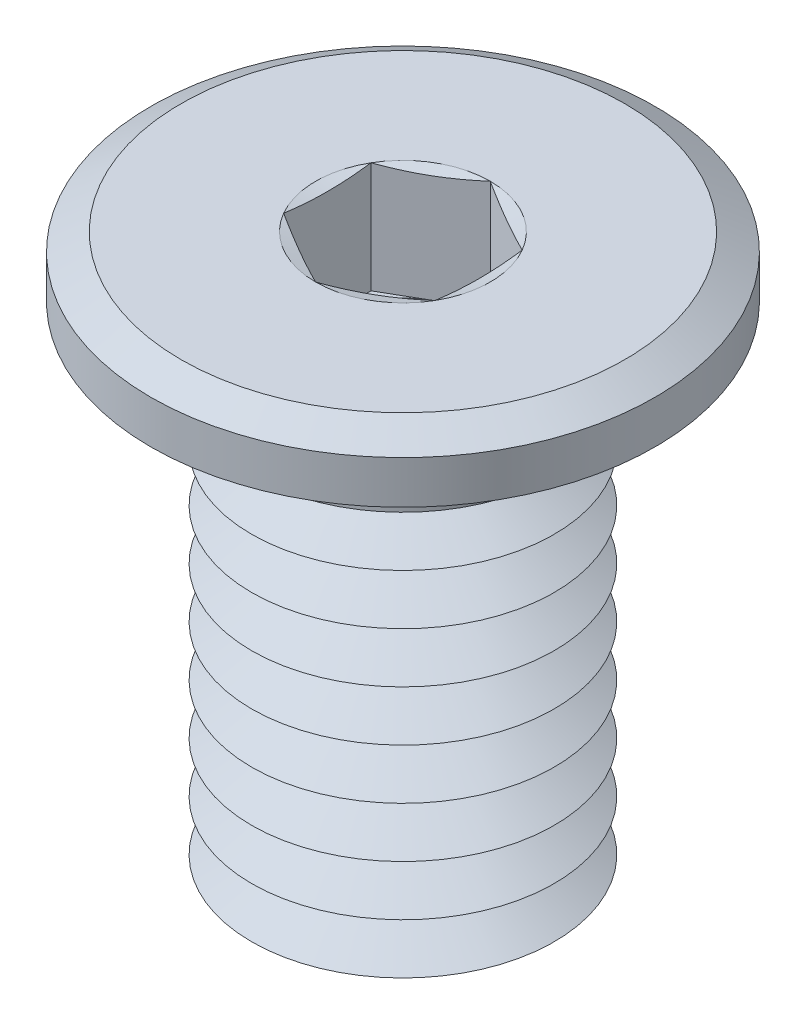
ISO-10303-21;
HEADER;
FILE_DESCRIPTION(('STEP AP214'),'2;1');
FILE_NAME('part.step','',(''),(''),'','','');
FILE_SCHEMA(('AUTOMOTIVE_DESIGN { 1 0 10303 214 1 1 1 1 }'));
ENDSEC;
DATA;
#1=APPLICATION_CONTEXT('core data for automotive mechanical design processes');
#2=APPLICATION_PROTOCOL_DEFINITION('international standard','automotive_design',2000,#1);
#3=PRODUCT_CONTEXT('',#1,'mechanical');
#4=PRODUCT('Part','Part','',(#3));
#5=PRODUCT_RELATED_PRODUCT_CATEGORY('part','',(#4));
#6=PRODUCT_DEFINITION_FORMATION('','',#4);
#7=PRODUCT_DEFINITION_CONTEXT('part definition',#1,'design');
#8=PRODUCT_DEFINITION('design','',#6,#7);
#9=PRODUCT_DEFINITION_SHAPE('','',#8);
#10=(LENGTH_UNIT() NAMED_UNIT(*) SI_UNIT(.MILLI.,.METRE.));
#11=(NAMED_UNIT(*) PLANE_ANGLE_UNIT() SI_UNIT($,.RADIAN.));
#12=(NAMED_UNIT(*) SI_UNIT($,.STERADIAN.) SOLID_ANGLE_UNIT());
#13=UNCERTAINTY_MEASURE_WITH_UNIT(LENGTH_MEASURE(1.E-05),#10,'distance_accuracy_value','');
#14=(GEOMETRIC_REPRESENTATION_CONTEXT(3) GLOBAL_UNCERTAINTY_ASSIGNED_CONTEXT((#13)) GLOBAL_UNIT_ASSIGNED_CONTEXT((#10,
#11,#12)) REPRESENTATION_CONTEXT('',''));
#15=CARTESIAN_POINT('',(0.,0.,0.));
#16=DIRECTION('',(0.,0.,1.));
#17=DIRECTION('',(1.,0.,0.));
#18=AXIS2_PLACEMENT_3D('',#15,#16,#17);
#19=CARTESIAN_POINT('',(0.,-9.7,0.));
#20=DIRECTION('',(0.,-1.,0.));
#21=DIRECTION('',(0.,0.,-1.));
#22=AXIS2_PLACEMENT_3D('',#19,#20,#21);
#23=CONICAL_SURFACE('',#22,3.,1.0471975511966);
#24=CARTESIAN_POINT('',(0.,-9.2,0.));
#25=DIRECTION('',(0.,1.,0.));
#26=DIRECTION('',(0.,0.,1.));
#27=AXIS2_PLACEMENT_3D('',#24,#25,#26);
#28=CIRCLE('',#27,2.13397459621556);
#29=CARTESIAN_POINT('',(0.,-9.2,2.13397459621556));
#30=VERTEX_POINT('',#29);
#31=EDGE_CURVE('E425',#30,#30,#28,.T.);
#32=ORIENTED_EDGE('',*,*,#31,.F.);
#33=EDGE_LOOP('',(#32));
#34=FACE_BOUND('',#33,.T.);
#35=CARTESIAN_POINT('',(0.,-9.7,0.));
#36=DIRECTION('',(0.,1.,0.));
#37=DIRECTION('',(0.,0.,1.));
#38=AXIS2_PLACEMENT_3D('',#35,#36,#37);
#39=CIRCLE('',#38,3.);
#40=CARTESIAN_POINT('',(0.,-9.7,3.));
#41=VERTEX_POINT('',#40);
#42=EDGE_CURVE('E429',#41,#41,#39,.T.);
#43=ORIENTED_EDGE('',*,*,#42,.T.);
#44=EDGE_LOOP('',(#43));
#45=FACE_BOUND('',#44,.T.);
#46=ADVANCED_FACE('F39',(#34,#45),#23,.T.);
#47=CARTESIAN_POINT('',(0.,-9.2,0.));
#48=DIRECTION('',(0.,1.,0.));
#49=DIRECTION('',(0.,0.,1.));
#50=AXIS2_PLACEMENT_3D('',#47,#48,#49);
#51=CONICAL_SURFACE('',#50,2.13397459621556,1.0471975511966);
#52=CARTESIAN_POINT('',(0.,-8.7,0.));
#53=DIRECTION('',(0.,1.,0.));
#54=DIRECTION('',(0.,0.,1.));
#55=AXIS2_PLACEMENT_3D('',#52,#53,#54);
#56=CIRCLE('',#55,3.);
#57=CARTESIAN_POINT('',(0.,-8.7,3.));
#58=VERTEX_POINT('',#57);
#59=EDGE_CURVE('E421',#58,#58,#56,.T.);
#60=ORIENTED_EDGE('',*,*,#59,.F.);
#61=EDGE_LOOP('',(#60));
#62=FACE_BOUND('',#61,.T.);
#63=ORIENTED_EDGE('',*,*,#31,.T.);
#64=EDGE_LOOP('',(#63));
#65=FACE_BOUND('',#64,.T.);
#66=ADVANCED_FACE('F233',(#62,#65),#51,.T.);
#67=CARTESIAN_POINT('',(0.,-11.2,0.));
#68=DIRECTION('',(0.,-1.,0.));
#69=DIRECTION('',(0.,0.,-1.));
#70=AXIS2_PLACEMENT_3D('',#67,#68,#69);
#71=PLANE('',#70);
#72=CARTESIAN_POINT('',(0.,-11.2,0.));
#73=DIRECTION('',(0.,1.,0.));
#74=DIRECTION('',(0.,0.,1.));
#75=AXIS2_PLACEMENT_3D('',#72,#73,#74);
#76=CIRCLE('',#75,2.13397459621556);
#77=CARTESIAN_POINT('',(0.,-11.2,2.13397459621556));
#78=VERTEX_POINT('',#77);
#79=EDGE_CURVE('E299',#78,#78,#76,.T.);
#80=ORIENTED_EDGE('',*,*,#79,.F.);
#81=EDGE_LOOP('',(#80));
#82=FACE_BOUND('',#81,.T.);
#83=ADVANCED_FACE('F239',(#82),#71,.T.);
#84=CARTESIAN_POINT('',(0.,-11.2,0.));
#85=DIRECTION('',(0.,1.,0.));
#86=DIRECTION('',(0.,0.,1.));
#87=AXIS2_PLACEMENT_3D('',#84,#85,#86);
#88=CONICAL_SURFACE('',#87,2.13397459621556,1.0471975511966);
#89=CARTESIAN_POINT('',(0.,-10.7,0.));
#90=DIRECTION('',(0.,1.,0.));
#91=DIRECTION('',(0.,0.,1.));
#92=AXIS2_PLACEMENT_3D('',#89,#90,#91);
#93=CIRCLE('',#92,3.);
#94=CARTESIAN_POINT('',(0.,-10.7,3.));
#95=VERTEX_POINT('',#94);
#96=EDGE_CURVE('E437',#95,#95,#93,.T.);
#97=ORIENTED_EDGE('',*,*,#96,.F.);
#98=EDGE_LOOP('',(#97));
#99=FACE_BOUND('',#98,.T.);
#100=ORIENTED_EDGE('',*,*,#79,.T.);
#101=EDGE_LOOP('',(#100));
#102=FACE_BOUND('',#101,.T.);
#103=ADVANCED_FACE('F254',(#99,#102),#88,.T.);
#104=CARTESIAN_POINT('',(0.,-10.7,0.));
#105=DIRECTION('',(0.,-1.,0.));
#106=DIRECTION('',(0.,0.,-1.));
#107=AXIS2_PLACEMENT_3D('',#104,#105,#106);
#108=CONICAL_SURFACE('',#107,3.,1.0471975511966);
#109=CARTESIAN_POINT('',(0.,-10.2,0.));
#110=DIRECTION('',(0.,1.,0.));
#111=DIRECTION('',(0.,0.,1.));
#112=AXIS2_PLACEMENT_3D('',#109,#110,#111);
#113=CIRCLE('',#112,2.13397459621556);
#114=CARTESIAN_POINT('',(0.,-10.2,2.13397459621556));
#115=VERTEX_POINT('',#114);
#116=EDGE_CURVE('E433',#115,#115,#113,.T.);
#117=ORIENTED_EDGE('',*,*,#116,.F.);
#118=EDGE_LOOP('',(#117));
#119=FACE_BOUND('',#118,.T.);
#120=ORIENTED_EDGE('',*,*,#96,.T.);
#121=EDGE_LOOP('',(#120));
#122=FACE_BOUND('',#121,.T.);
#123=ADVANCED_FACE('F250',(#119,#122),#108,.T.);
#124=CARTESIAN_POINT('',(0.,-10.2,0.));
#125=DIRECTION('',(0.,1.,0.));
#126=DIRECTION('',(0.,0.,1.));
#127=AXIS2_PLACEMENT_3D('',#124,#125,#126);
#128=CONICAL_SURFACE('',#127,2.13397459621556,1.0471975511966);
#129=ORIENTED_EDGE('',*,*,#42,.F.);
#130=EDGE_LOOP('',(#129));
#131=FACE_BOUND('',#130,.T.);
#132=ORIENTED_EDGE('',*,*,#116,.T.);
#133=EDGE_LOOP('',(#132));
#134=FACE_BOUND('',#133,.T.);
#135=ADVANCED_FACE('F246',(#131,#134),#128,.T.);
#136=CARTESIAN_POINT('',(0.,-8.7,0.));
#137=DIRECTION('',(0.,-1.,0.));
#138=DIRECTION('',(0.,0.,-1.));
#139=AXIS2_PLACEMENT_3D('',#136,#137,#138);
#140=CONICAL_SURFACE('',#139,3.,1.0471975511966);
#141=CARTESIAN_POINT('',(0.,-8.2,0.));
#142=DIRECTION('',(0.,1.,0.));
#143=DIRECTION('',(0.,0.,1.));
#144=AXIS2_PLACEMENT_3D('',#141,#142,#143);
#145=CIRCLE('',#144,2.13397459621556);
#146=CARTESIAN_POINT('',(0.,-8.2,2.13397459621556));
#147=VERTEX_POINT('',#146);
#148=EDGE_CURVE('E417',#147,#147,#145,.T.);
#149=ORIENTED_EDGE('',*,*,#148,.F.);
#150=EDGE_LOOP('',(#149));
#151=FACE_BOUND('',#150,.T.);
#152=ORIENTED_EDGE('',*,*,#59,.T.);
#153=EDGE_LOOP('',(#152));
#154=FACE_BOUND('',#153,.T.);
#155=ADVANCED_FACE('F249',(#151,#154),#140,.T.);
#156=CARTESIAN_POINT('',(0.,-8.2,0.));
#157=DIRECTION('',(0.,1.,0.));
#158=DIRECTION('',(0.,0.,1.));
#159=AXIS2_PLACEMENT_3D('',#156,#157,#158);
#160=CONICAL_SURFACE('',#159,2.13397459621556,1.0471975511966);
#161=CARTESIAN_POINT('',(0.,-7.7,0.));
#162=DIRECTION('',(0.,1.,0.));
#163=DIRECTION('',(0.,0.,1.));
#164=AXIS2_PLACEMENT_3D('',#161,#162,#163);
#165=CIRCLE('',#164,3.);
#166=CARTESIAN_POINT('',(0.,-7.7,3.));
#167=VERTEX_POINT('',#166);
#168=EDGE_CURVE('E413',#167,#167,#165,.T.);
#169=ORIENTED_EDGE('',*,*,#168,.F.);
#170=EDGE_LOOP('',(#169));
#171=FACE_BOUND('',#170,.T.);
#172=ORIENTED_EDGE('',*,*,#148,.T.);
#173=EDGE_LOOP('',(#172));
#174=FACE_BOUND('',#173,.T.);
#175=ADVANCED_FACE('F628',(#171,#174),#160,.T.);
#176=CARTESIAN_POINT('',(0.,-7.7,0.));
#177=DIRECTION('',(0.,-1.,0.));
#178=DIRECTION('',(0.,0.,-1.));
#179=AXIS2_PLACEMENT_3D('',#176,#177,#178);
#180=CONICAL_SURFACE('',#179,3.,1.0471975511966);
#181=CARTESIAN_POINT('',(0.,-7.2,0.));
#182=DIRECTION('',(0.,1.,0.));
#183=DIRECTION('',(0.,0.,1.));
#184=AXIS2_PLACEMENT_3D('',#181,#182,#183);
#185=CIRCLE('',#184,2.13397459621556);
#186=CARTESIAN_POINT('',(0.,-7.2,2.13397459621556));
#187=VERTEX_POINT('',#186);
#188=EDGE_CURVE('E409',#187,#187,#185,.T.);
#189=ORIENTED_EDGE('',*,*,#188,.F.);
#190=EDGE_LOOP('',(#189));
#191=FACE_BOUND('',#190,.T.);
#192=ORIENTED_EDGE('',*,*,#168,.T.);
#193=EDGE_LOOP('',(#192));
#194=FACE_BOUND('',#193,.T.);
#195=ADVANCED_FACE('F619',(#191,#194),#180,.T.);
#196=CARTESIAN_POINT('',(0.,-7.2,0.));
#197=DIRECTION('',(0.,1.,0.));
#198=DIRECTION('',(0.,0.,1.));
#199=AXIS2_PLACEMENT_3D('',#196,#197,#198);
#200=CONICAL_SURFACE('',#199,2.13397459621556,1.0471975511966);
#201=CARTESIAN_POINT('',(0.,-6.7,0.));
#202=DIRECTION('',(0.,1.,0.));
#203=DIRECTION('',(0.,0.,1.));
#204=AXIS2_PLACEMENT_3D('',#201,#202,#203);
#205=CIRCLE('',#204,3.);
#206=CARTESIAN_POINT('',(0.,-6.7,3.));
#207=VERTEX_POINT('',#206);
#208=EDGE_CURVE('E405',#207,#207,#205,.T.);
#209=ORIENTED_EDGE('',*,*,#208,.F.);
#210=EDGE_LOOP('',(#209));
#211=FACE_BOUND('',#210,.T.);
#212=ORIENTED_EDGE('',*,*,#188,.T.);
#213=EDGE_LOOP('',(#212));
#214=FACE_BOUND('',#213,.T.);
#215=ADVANCED_FACE('F610',(#211,#214),#200,.T.);
#216=CARTESIAN_POINT('',(0.,-6.7,0.));
#217=DIRECTION('',(0.,-1.,0.));
#218=DIRECTION('',(0.,0.,-1.));
#219=AXIS2_PLACEMENT_3D('',#216,#217,#218);
#220=CONICAL_SURFACE('',#219,3.,1.0471975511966);
#221=CARTESIAN_POINT('',(0.,-6.2,0.));
#222=DIRECTION('',(0.,1.,0.));
#223=DIRECTION('',(0.,0.,1.));
#224=AXIS2_PLACEMENT_3D('',#221,#222,#223);
#225=CIRCLE('',#224,2.13397459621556);
#226=CARTESIAN_POINT('',(0.,-6.2,2.13397459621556));
#227=VERTEX_POINT('',#226);
#228=EDGE_CURVE('E401',#227,#227,#225,.T.);
#229=ORIENTED_EDGE('',*,*,#228,.F.);
#230=EDGE_LOOP('',(#229));
#231=FACE_BOUND('',#230,.T.);
#232=ORIENTED_EDGE('',*,*,#208,.T.);
#233=EDGE_LOOP('',(#232));
#234=FACE_BOUND('',#233,.T.);
#235=ADVANCED_FACE('F601',(#231,#234),#220,.T.);
#236=CARTESIAN_POINT('',(0.,-6.2,0.));
#237=DIRECTION('',(0.,1.,0.));
#238=DIRECTION('',(0.,0.,1.));
#239=AXIS2_PLACEMENT_3D('',#236,#237,#238);
#240=CONICAL_SURFACE('',#239,2.13397459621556,1.0471975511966);
#241=CARTESIAN_POINT('',(0.,-5.7,0.));
#242=DIRECTION('',(0.,1.,0.));
#243=DIRECTION('',(0.,0.,1.));
#244=AXIS2_PLACEMENT_3D('',#241,#242,#243);
#245=CIRCLE('',#244,3.);
#246=CARTESIAN_POINT('',(0.,-5.7,3.));
#247=VERTEX_POINT('',#246);
#248=EDGE_CURVE('E397',#247,#247,#245,.T.);
#249=ORIENTED_EDGE('',*,*,#248,.F.);
#250=EDGE_LOOP('',(#249));
#251=FACE_BOUND('',#250,.T.);
#252=ORIENTED_EDGE('',*,*,#228,.T.);
#253=EDGE_LOOP('',(#252));
#254=FACE_BOUND('',#253,.T.);
#255=ADVANCED_FACE('F592',(#251,#254),#240,.T.);
#256=CARTESIAN_POINT('',(0.,-5.7,0.));
#257=DIRECTION('',(0.,-1.,0.));
#258=DIRECTION('',(0.,0.,-1.));
#259=AXIS2_PLACEMENT_3D('',#256,#257,#258);
#260=CONICAL_SURFACE('',#259,3.,1.0471975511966);
#261=CARTESIAN_POINT('',(0.,-5.2,0.));
#262=DIRECTION('',(0.,1.,0.));
#263=DIRECTION('',(0.,0.,1.));
#264=AXIS2_PLACEMENT_3D('',#261,#262,#263);
#265=CIRCLE('',#264,2.13397459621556);
#266=CARTESIAN_POINT('',(0.,-5.2,2.13397459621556));
#267=VERTEX_POINT('',#266);
#268=EDGE_CURVE('E393',#267,#267,#265,.T.);
#269=ORIENTED_EDGE('',*,*,#268,.F.);
#270=EDGE_LOOP('',(#269));
#271=FACE_BOUND('',#270,.T.);
#272=ORIENTED_EDGE('',*,*,#248,.T.);
#273=EDGE_LOOP('',(#272));
#274=FACE_BOUND('',#273,.T.);
#275=ADVANCED_FACE('F583',(#271,#274),#260,.T.);
#276=CARTESIAN_POINT('',(0.,-5.2,0.));
#277=DIRECTION('',(0.,1.,0.));
#278=DIRECTION('',(0.,0.,1.));
#279=AXIS2_PLACEMENT_3D('',#276,#277,#278);
#280=CONICAL_SURFACE('',#279,2.13397459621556,1.0471975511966);
#281=CARTESIAN_POINT('',(0.,-4.7,0.));
#282=DIRECTION('',(0.,1.,0.));
#283=DIRECTION('',(0.,0.,1.));
#284=AXIS2_PLACEMENT_3D('',#281,#282,#283);
#285=CIRCLE('',#284,3.);
#286=CARTESIAN_POINT('',(0.,-4.7,3.));
#287=VERTEX_POINT('',#286);
#288=EDGE_CURVE('E390',#287,#287,#285,.T.);
#289=ORIENTED_EDGE('',*,*,#288,.F.);
#290=EDGE_LOOP('',(#289));
#291=FACE_BOUND('',#290,.T.);
#292=ORIENTED_EDGE('',*,*,#268,.T.);
#293=EDGE_LOOP('',(#292));
#294=FACE_BOUND('',#293,.T.);
#295=ADVANCED_FACE('F574',(#291,#294),#280,.T.);
#296=CARTESIAN_POINT('',(0.,-4.7,0.));
#297=DIRECTION('',(0.,-1.,0.));
#298=DIRECTION('',(0.,0.,-1.));
#299=AXIS2_PLACEMENT_3D('',#296,#297,#298);
#300=CONICAL_SURFACE('',#299,3.,1.0471975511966);
#301=CARTESIAN_POINT('',(0.,-4.2,0.));
#302=DIRECTION('',(0.,1.,0.));
#303=DIRECTION('',(0.,0.,1.));
#304=AXIS2_PLACEMENT_3D('',#301,#302,#303);
#305=CIRCLE('',#304,2.13397459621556);
#306=CARTESIAN_POINT('',(0.,-4.2,2.13397459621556));
#307=VERTEX_POINT('',#306);
#308=EDGE_CURVE('E386',#307,#307,#305,.T.);
#309=ORIENTED_EDGE('',*,*,#308,.F.);
#310=EDGE_LOOP('',(#309));
#311=FACE_BOUND('',#310,.T.);
#312=ORIENTED_EDGE('',*,*,#288,.T.);
#313=EDGE_LOOP('',(#312));
#314=FACE_BOUND('',#313,.T.);
#315=ADVANCED_FACE('F565',(#311,#314),#300,.T.);
#316=CARTESIAN_POINT('',(0.,-4.2,0.));
#317=DIRECTION('',(0.,1.,0.));
#318=DIRECTION('',(0.,0.,1.));
#319=AXIS2_PLACEMENT_3D('',#316,#317,#318);
#320=CONICAL_SURFACE('',#319,2.13397459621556,1.0471975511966);
#321=CARTESIAN_POINT('',(0.,-3.7,0.));
#322=DIRECTION('',(0.,1.,0.));
#323=DIRECTION('',(0.,0.,1.));
#324=AXIS2_PLACEMENT_3D('',#321,#322,#323);
#325=CIRCLE('',#324,3.);
#326=CARTESIAN_POINT('',(0.,-3.7,3.));
#327=VERTEX_POINT('',#326);
#328=EDGE_CURVE('E383',#327,#327,#325,.T.);
#329=ORIENTED_EDGE('',*,*,#328,.F.);
#330=EDGE_LOOP('',(#329));
#331=FACE_BOUND('',#330,.T.);
#332=ORIENTED_EDGE('',*,*,#308,.T.);
#333=EDGE_LOOP('',(#332));
#334=FACE_BOUND('',#333,.T.);
#335=ADVANCED_FACE('F556',(#331,#334),#320,.T.);
#336=CARTESIAN_POINT('',(0.,-3.7,0.));
#337=DIRECTION('',(0.,-1.,0.));
#338=DIRECTION('',(0.,0.,-1.));
#339=AXIS2_PLACEMENT_3D('',#336,#337,#338);
#340=CONICAL_SURFACE('',#339,3.,1.0471975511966);
#341=CARTESIAN_POINT('',(0.,-3.2,0.));
#342=DIRECTION('',(0.,1.,0.));
#343=DIRECTION('',(0.,0.,1.));
#344=AXIS2_PLACEMENT_3D('',#341,#342,#343);
#345=CIRCLE('',#344,2.13397459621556);
#346=CARTESIAN_POINT('',(0.,-3.2,2.13397459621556));
#347=VERTEX_POINT('',#346);
#348=EDGE_CURVE('E379',#347,#347,#345,.T.);
#349=ORIENTED_EDGE('',*,*,#348,.F.);
#350=EDGE_LOOP('',(#349));
#351=FACE_BOUND('',#350,.T.);
#352=ORIENTED_EDGE('',*,*,#328,.T.);
#353=EDGE_LOOP('',(#352));
#354=FACE_BOUND('',#353,.T.);
#355=ADVANCED_FACE('F547',(#351,#354),#340,.T.);
#356=CARTESIAN_POINT('',(0.,-3.2,0.));
#357=DIRECTION('',(0.,1.,0.));
#358=DIRECTION('',(0.,0.,1.));
#359=AXIS2_PLACEMENT_3D('',#356,#357,#358);
#360=CONICAL_SURFACE('',#359,2.13397459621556,1.0471975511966);
#361=CARTESIAN_POINT('',(0.,-2.7,0.));
#362=DIRECTION('',(0.,1.,0.));
#363=DIRECTION('',(0.,0.,1.));
#364=AXIS2_PLACEMENT_3D('',#361,#362,#363);
#365=CIRCLE('',#364,3.);
#366=CARTESIAN_POINT('',(0.,-2.7,3.));
#367=VERTEX_POINT('',#366);
#368=EDGE_CURVE('E365',#367,#367,#365,.T.);
#369=ORIENTED_EDGE('',*,*,#368,.F.);
#370=EDGE_LOOP('',(#369));
#371=FACE_BOUND('',#370,.T.);
#372=ORIENTED_EDGE('',*,*,#348,.T.);
#373=EDGE_LOOP('',(#372));
#374=FACE_BOUND('',#373,.T.);
#375=ADVANCED_FACE('F274',(#371,#374),#360,.T.);
#376=CARTESIAN_POINT('',(0.,0.,0.));
#377=DIRECTION('',(0.,1.,0.));
#378=DIRECTION('',(0.,0.,1.));
#379=AXIS2_PLACEMENT_3D('',#376,#377,#378);
#380=PLANE('',#379);
#381=CARTESIAN_POINT('',(0.,0.,0.));
#382=DIRECTION('',(0.,1.,0.));
#383=DIRECTION('',(0.,0.,1.));
#384=AXIS2_PLACEMENT_3D('',#381,#382,#383);
#385=CIRCLE('',#384,1.73205080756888);
#386=CARTESIAN_POINT('',(0.,0.,1.73205080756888));
#387=VERTEX_POINT('',#386);
#388=CARTESIAN_POINT('',(1.5,0.,0.86602540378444));
#389=VERTEX_POINT('',#388);
#390=EDGE_CURVE('E66',#387,#389,#385,.T.);
#391=ORIENTED_EDGE('',*,*,#390,.F.);
#392=CARTESIAN_POINT('',(-1.5,0.,0.866025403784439));
#393=VERTEX_POINT('',#392);
#394=EDGE_CURVE('E169',#393,#387,#385,.T.);
#395=ORIENTED_EDGE('',*,*,#394,.F.);
#396=CARTESIAN_POINT('',(-1.5,0.,-0.86602540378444));
#397=VERTEX_POINT('',#396);
#398=EDGE_CURVE('E164',#397,#393,#385,.T.);
#399=ORIENTED_EDGE('',*,*,#398,.F.);
#400=CARTESIAN_POINT('',(0.,0.,-1.73205080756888));
#401=VERTEX_POINT('',#400);
#402=EDGE_CURVE('E128',#401,#397,#385,.T.);
#403=ORIENTED_EDGE('',*,*,#402,.F.);
#404=CARTESIAN_POINT('',(1.5,0.,-0.866025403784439));
#405=VERTEX_POINT('',#404);
#406=EDGE_CURVE('E119',#405,#401,#385,.T.);
#407=ORIENTED_EDGE('',*,*,#406,.F.);
#408=EDGE_CURVE('E59',#389,#405,#385,.T.);
#409=ORIENTED_EDGE('',*,*,#408,.F.);
#410=EDGE_LOOP('',(#391,#395,#399,#403,#407,#409));
#411=FACE_BOUND('',#410,.T.);
#412=CARTESIAN_POINT('',(0.,0.,0.));
#413=DIRECTION('',(0.,1.,0.));
#414=DIRECTION('',(0.,0.,1.));
#415=AXIS2_PLACEMENT_3D('',#412,#413,#414);
#416=CIRCLE('',#415,4.4);
#417=CARTESIAN_POINT('',(0.,0.,4.4));
#418=VERTEX_POINT('',#417);
#419=EDGE_CURVE('E295',#418,#418,#416,.T.);
#420=ORIENTED_EDGE('',*,*,#419,.T.);
#421=EDGE_LOOP('',(#420));
#422=FACE_BOUND('',#421,.T.);
#423=ADVANCED_FACE('F160',(#411,#422),#380,.T.);
#424=CARTESIAN_POINT('',(0.,-1.2,0.));
#425=DIRECTION('',(0.,1.,0.));
#426=DIRECTION('',(0.,0.,1.));
#427=AXIS2_PLACEMENT_3D('',#424,#425,#426);
#428=CYLINDRICAL_SURFACE('',#427,5.);
#429=CARTESIAN_POINT('',(0.,-0.346410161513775,0.));
#430=DIRECTION('',(0.,1.,0.));
#431=DIRECTION('',(0.,0.,1.));
#432=AXIS2_PLACEMENT_3D('',#429,#430,#431);
#433=CIRCLE('',#432,5.);
#434=CARTESIAN_POINT('',(0.,-0.346410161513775,5.));
#435=VERTEX_POINT('',#434);
#436=EDGE_CURVE('E306',#435,#435,#433,.F.);
#437=ORIENTED_EDGE('',*,*,#436,.T.);
#438=EDGE_LOOP('',(#437));
#439=FACE_BOUND('',#438,.T.);
#440=CARTESIAN_POINT('',(0.,-1.2,0.));
#441=DIRECTION('',(0.,1.,0.));
#442=DIRECTION('',(0.,0.,1.));
#443=AXIS2_PLACEMENT_3D('',#440,#441,#442);
#444=CIRCLE('',#443,5.);
#445=CARTESIAN_POINT('',(0.,-1.2,5.));
#446=VERTEX_POINT('',#445);
#447=EDGE_CURVE('E291',#446,#446,#444,.T.);
#448=ORIENTED_EDGE('',*,*,#447,.T.);
#449=EDGE_LOOP('',(#448));
#450=FACE_BOUND('',#449,.T.);
#451=ADVANCED_FACE('F270',(#439,#450),#428,.T.);
#452=CARTESIAN_POINT('',(0.,-1.2,0.));
#453=DIRECTION('',(0.,1.,0.));
#454=DIRECTION('',(0.,0.,1.));
#455=AXIS2_PLACEMENT_3D('',#452,#453,#454);
#456=PLANE('',#455);
#457=CARTESIAN_POINT('',(0.,-1.2,0.));
#458=DIRECTION('',(0.,1.,0.));
#459=DIRECTION('',(0.,0.,1.));
#460=AXIS2_PLACEMENT_3D('',#457,#458,#459);
#461=CIRCLE('',#460,3.25);
#462=CARTESIAN_POINT('',(0.,-1.2,3.25));
#463=VERTEX_POINT('',#462);
#464=EDGE_CURVE('E286',#463,#463,#461,.T.);
#465=ORIENTED_EDGE('',*,*,#464,.T.);
#466=EDGE_LOOP('',(#465));
#467=FACE_BOUND('',#466,.T.);
#468=ORIENTED_EDGE('',*,*,#447,.F.);
#469=EDGE_LOOP('',(#468));
#470=FACE_BOUND('',#469,.T.);
#471=ADVANCED_FACE('F266',(#467,#470),#456,.F.);
#472=CARTESIAN_POINT('',(0.,-11.2,0.));
#473=DIRECTION('',(0.,1.,0.));
#474=DIRECTION('',(0.,0.,1.));
#475=AXIS2_PLACEMENT_3D('',#472,#473,#474);
#476=CYLINDRICAL_SURFACE('',#475,3.);
#477=CARTESIAN_POINT('',(0.,-1.45,0.));
#478=DIRECTION('',(0.,1.,0.));
#479=DIRECTION('',(0.,0.,1.));
#480=AXIS2_PLACEMENT_3D('',#477,#478,#479);
#481=CIRCLE('',#480,3.);
#482=CARTESIAN_POINT('',(0.,-1.45,3.));
#483=VERTEX_POINT('',#482);
#484=EDGE_CURVE('E289',#483,#483,#481,.F.);
#485=ORIENTED_EDGE('',*,*,#484,.T.);
#486=EDGE_LOOP('',(#485));
#487=FACE_BOUND('',#486,.T.);
#488=ORIENTED_EDGE('',*,*,#368,.T.);
#489=EDGE_LOOP('',(#488));
#490=FACE_BOUND('',#489,.T.);
#491=ADVANCED_FACE('F262',(#487,#490),#476,.T.);
#492=CARTESIAN_POINT('',(0.,-1.45,0.));
#493=DIRECTION('',(0.,1.,0.));
#494=DIRECTION('',(0.,0.,1.));
#495=AXIS2_PLACEMENT_3D('',#492,#493,#494);
#496=TOROIDAL_SURFACE('',#495,3.25,0.25);
#497=ORIENTED_EDGE('',*,*,#464,.F.);
#498=EDGE_LOOP('',(#497));
#499=FACE_BOUND('',#498,.T.);
#500=ORIENTED_EDGE('',*,*,#484,.F.);
#501=EDGE_LOOP('',(#500));
#502=FACE_BOUND('',#501,.T.);
#503=ADVANCED_FACE('F265',(#499,#502),#496,.F.);
#504=CARTESIAN_POINT('',(0.,0.,0.));
#505=DIRECTION('',(0.,-1.,0.));
#506=DIRECTION('',(0.,0.,-1.));
#507=AXIS2_PLACEMENT_3D('',#504,#505,#506);
#508=CONICAL_SURFACE('',#507,4.4,1.0471975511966);
#509=ORIENTED_EDGE('',*,*,#436,.F.);
#510=EDGE_LOOP('',(#509));
#511=FACE_BOUND('',#510,.T.);
#512=ORIENTED_EDGE('',*,*,#419,.F.);
#513=EDGE_LOOP('',(#512));
#514=FACE_BOUND('',#513,.T.);
#515=ADVANCED_FACE('F41',(#511,#514),#508,.T.);
#516=CARTESIAN_POINT('',(0.,0.,0.));
#517=DIRECTION('',(0.,1.,0.));
#518=DIRECTION('',(0.,0.,1.));
#519=AXIS2_PLACEMENT_3D('',#516,#517,#518);
#520=CONICAL_SURFACE('',#519,1.73205080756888,1.30899693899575);
#521=ORIENTED_EDGE('',*,*,#402,.T.);
#522=CARTESIAN_POINT('',(0.000200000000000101,3.09432014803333E-05,-1.73216627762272));
#523=CARTESIAN_POINT('',(-0.0621077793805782,-0.00961367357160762,-1.69619286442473));
#524=CARTESIAN_POINT('',(-0.124528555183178,-0.0183695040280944,-1.66015421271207));
#525=CARTESIAN_POINT('',(-0.249590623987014,-0.0337528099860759,-1.58794959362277));
#526=CARTESIAN_POINT('',(-0.312231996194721,-0.0403794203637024,-1.55178358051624));
#527=CARTESIAN_POINT('',(-0.437355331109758,-0.0511173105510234,-1.47954358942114));
#528=CARTESIAN_POINT('',(-0.499836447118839,-0.0552413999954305,-1.44347010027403));
#529=CARTESIAN_POINT('',(-0.624878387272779,-0.0607713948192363,-1.37127710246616));
#530=CARTESIAN_POINT('',(-0.68743919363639,-0.0621778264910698,-1.33515760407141));
#531=CARTESIAN_POINT('',(-0.81256080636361,-0.0621778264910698,-1.26291860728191));
#532=CARTESIAN_POINT('',(-0.875121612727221,-0.0607713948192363,-1.22679910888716));
#533=CARTESIAN_POINT('',(-1.00016355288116,-0.0552413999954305,-1.15460611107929));
#534=CARTESIAN_POINT('',(-1.06264466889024,-0.0511173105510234,-1.11853262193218));
#535=CARTESIAN_POINT('',(-1.18776800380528,-0.0403794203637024,-1.04629263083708));
#536=CARTESIAN_POINT('',(-1.25040937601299,-0.0337528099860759,-1.01012661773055));
#537=CARTESIAN_POINT('',(-1.37547144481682,-0.0183695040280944,-0.937921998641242));
#538=CARTESIAN_POINT('',(-1.43789222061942,-0.00961367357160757,-0.901883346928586));
#539=CARTESIAN_POINT('',(-1.5002,3.09432014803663E-05,-0.865909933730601));
#540=B_SPLINE_CURVE_WITH_KNOTS('',3,(#522,#523,#524,#525,#526,#527,#528,#529,#530,#531,#532,
#533,#534,#535,#536,#537,#538,#539),.UNSPECIFIED.,.F.,.F.,(4,2,2,2,2,2,2,2,4),(0.,
0.217782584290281,0.435653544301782,0.652399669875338,0.869103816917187,1.08580796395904,
1.30255408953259,1.52042504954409,1.73820763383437),.UNSPECIFIED.);
#541=EDGE_CURVE('E11',#401,#397,#540,.T.);
#542=ORIENTED_EDGE('',*,*,#541,.F.);
#543=EDGE_LOOP('',(#521,#542));
#544=FACE_BOUND('',#543,.T.);
#545=ADVANCED_FACE('F132',(#544),#520,.F.);
#546=ORIENTED_EDGE('',*,*,#398,.T.);
#547=CARTESIAN_POINT('',(-1.5,0.354011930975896,-2.65937634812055));
#548=CARTESIAN_POINT('',(-1.5,0.324139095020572,-2.53120070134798));
#549=CARTESIAN_POINT('',(-1.5,0.294685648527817,-2.40292071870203));
#550=CARTESIAN_POINT('',(-1.5,0.237197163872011,-2.14601955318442));
#551=CARTESIAN_POINT('',(-1.5,0.209162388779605,-2.01739831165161));
#552=CARTESIAN_POINT('',(-1.5,0.154839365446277,-1.7584759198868));
#553=CARTESIAN_POINT('',(-1.5,0.128570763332,-1.62817060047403));
#554=CARTESIAN_POINT('',(-1.5,0.079114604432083,-1.36695300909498));
#555=CARTESIAN_POINT('',(-1.5,0.0559273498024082,-1.23604067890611));
#556=CARTESIAN_POINT('',(-1.5,0.014778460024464,-0.977065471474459));
#557=CARTESIAN_POINT('',(-1.5,-0.00330931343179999,-0.849023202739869));
#558=CARTESIAN_POINT('',(-1.5,-0.0330965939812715,-0.592203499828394));
#559=CARTESIAN_POINT('',(-1.5,-0.044798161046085,-0.463426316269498));
#560=CARTESIAN_POINT('',(-1.5,-0.0597912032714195,-0.205943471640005));
#561=CARTESIAN_POINT('',(-1.5,-0.0631209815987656,-0.0772401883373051));
#562=CARTESIAN_POINT('',(-1.5,-0.0607624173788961,0.180089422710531));
#563=CARTESIAN_POINT('',(-1.5,-0.0550734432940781,0.30871574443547));
#564=CARTESIAN_POINT('',(-1.5,-0.0385156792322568,0.529862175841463));
#565=CARTESIAN_POINT('',(-1.5,-0.0295136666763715,0.622533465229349));
#566=CARTESIAN_POINT('',(-1.5,-0.00818858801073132,0.807485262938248));
#567=CARTESIAN_POINT('',(-1.5,0.00413439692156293,0.899765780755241));
#568=CARTESIAN_POINT('',(-1.5,0.0313970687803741,1.08424538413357));
#569=CARTESIAN_POINT('',(-1.5,0.0463453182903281,1.17644317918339));
#570=CARTESIAN_POINT('',(-1.5,0.0781915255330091,1.36050255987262));
#571=CARTESIAN_POINT('',(-1.5,0.0950895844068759,1.45236412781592));
#572=CARTESIAN_POINT('',(-1.5,0.130717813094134,1.6377417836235));
#573=CARTESIAN_POINT('',(-1.5,0.149479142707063,1.73125183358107));
#574=CARTESIAN_POINT('',(-1.5,0.188141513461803,1.91803588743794));
#575=CARTESIAN_POINT('',(-1.5,0.208042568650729,2.01130988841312));
#576=CARTESIAN_POINT('',(-1.5,0.248588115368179,2.19713640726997));
#577=CARTESIAN_POINT('',(-1.5,0.269227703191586,2.28969000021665));
#578=CARTESIAN_POINT('',(-1.5,0.311169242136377,2.47464021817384));
#579=CARTESIAN_POINT('',(-1.5,0.332471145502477,2.5670368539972));
#580=CARTESIAN_POINT('',(-1.5,0.354011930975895,2.65937634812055));
#581=B_SPLINE_CURVE_WITH_KNOTS('',3,(#547,#548,#549,#550,#551,#552,#553,#554,#555,#556,#557,
#558,#559,#560,#561,#562,#563,#564,#565,#566,#567,#568,#569,#570,#571,#572,#573,#574,#575,#576,
#577,#578,#579,#580),.UNSPECIFIED.,.F.,.F.,(4,2,2,2,2,2,2,2,2,2,2,2,2,2,2,2,4),(0.,
0.3948412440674,0.789755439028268,1.18851185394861,1.58730734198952,1.97513907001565,
2.36284562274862,2.74877505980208,3.13473152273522,3.41398847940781,3.69323861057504,
3.97341705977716,4.25361004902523,4.53972148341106,4.82583644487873,5.1103147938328,
5.39477267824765),.UNSPECIFIED.);
#582=EDGE_CURVE('E172',#397,#393,#581,.T.);
#583=ORIENTED_EDGE('',*,*,#582,.F.);
#584=EDGE_LOOP('',(#546,#583));
#585=FACE_BOUND('',#584,.T.);
#586=ADVANCED_FACE('F504',(#585),#520,.F.);
#587=ORIENTED_EDGE('',*,*,#394,.T.);
#588=CARTESIAN_POINT('',(-1.5002,3.09432014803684E-05,0.865909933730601));
#589=CARTESIAN_POINT('',(-1.43789222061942,-0.00961367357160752,0.901883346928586));
#590=CARTESIAN_POINT('',(-1.37547144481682,-0.0183695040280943,0.937921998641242));
#591=CARTESIAN_POINT('',(-1.25040937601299,-0.0337528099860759,1.01012661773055));
#592=CARTESIAN_POINT('',(-1.18776800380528,-0.0403794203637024,1.04629263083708));
#593=CARTESIAN_POINT('',(-1.06264466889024,-0.0511173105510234,1.11853262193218));
#594=CARTESIAN_POINT('',(-1.00016355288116,-0.0552413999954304,1.15460611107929));
#595=CARTESIAN_POINT('',(-0.875121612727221,-0.0607713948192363,1.22679910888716));
#596=CARTESIAN_POINT('',(-0.812560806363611,-0.0621778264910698,1.26291860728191));
#597=CARTESIAN_POINT('',(-0.68743919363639,-0.0621778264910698,1.33515760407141));
#598=CARTESIAN_POINT('',(-0.624878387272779,-0.0607713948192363,1.37127710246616));
#599=CARTESIAN_POINT('',(-0.499836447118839,-0.0552413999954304,1.44347010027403));
#600=CARTESIAN_POINT('',(-0.437355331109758,-0.0511173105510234,1.47954358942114));
#601=CARTESIAN_POINT('',(-0.312231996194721,-0.0403794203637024,1.55178358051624));
#602=CARTESIAN_POINT('',(-0.249590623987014,-0.0337528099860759,1.58794959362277));
#603=CARTESIAN_POINT('',(-0.124528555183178,-0.0183695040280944,1.66015421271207));
#604=CARTESIAN_POINT('',(-0.0621077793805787,-0.00961367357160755,1.69619286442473));
#605=CARTESIAN_POINT('',(0.000199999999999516,3.09432014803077E-05,1.73216627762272));
#606=B_SPLINE_CURVE_WITH_KNOTS('',3,(#588,#589,#590,#591,#592,#593,#594,#595,#596,#597,#598,
#599,#600,#601,#602,#603,#604,#605),.UNSPECIFIED.,.F.,.F.,(4,2,2,2,2,2,2,2,4),(0.,
0.217782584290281,0.435653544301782,0.652399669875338,0.869103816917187,1.08580796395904,
1.30255408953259,1.52042504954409,1.73820763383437),.UNSPECIFIED.);
#607=EDGE_CURVE('E180',#393,#387,#606,.T.);
#608=ORIENTED_EDGE('',*,*,#607,.F.);
#609=EDGE_LOOP('',(#587,#608));
#610=FACE_BOUND('',#609,.T.);
#611=ADVANCED_FACE('F499',(#610),#520,.F.);
#612=ORIENTED_EDGE('',*,*,#390,.T.);
#613=CARTESIAN_POINT('',(-0.000200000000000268,3.09432014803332E-05,1.73216627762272));
#614=CARTESIAN_POINT('',(0.062107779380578,-0.00961367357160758,1.69619286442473));
#615=CARTESIAN_POINT('',(0.124528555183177,-0.0183695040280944,1.66015421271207));
#616=CARTESIAN_POINT('',(0.249590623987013,-0.0337528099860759,1.58794959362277));
#617=CARTESIAN_POINT('',(0.312231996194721,-0.0403794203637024,1.55178358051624));
#618=CARTESIAN_POINT('',(0.437355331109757,-0.0511173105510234,1.47954358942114));
#619=CARTESIAN_POINT('',(0.499836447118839,-0.0552413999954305,1.44347010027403));
#620=CARTESIAN_POINT('',(0.624878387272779,-0.0607713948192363,1.37127710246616));
#621=CARTESIAN_POINT('',(0.687439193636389,-0.0621778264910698,1.33515760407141));
#622=CARTESIAN_POINT('',(0.81256080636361,-0.0621778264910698,1.26291860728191));
#623=CARTESIAN_POINT('',(0.87512161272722,-0.0607713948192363,1.22679910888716));
#624=CARTESIAN_POINT('',(1.00016355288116,-0.0552413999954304,1.15460611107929));
#625=CARTESIAN_POINT('',(1.06264466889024,-0.0511173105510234,1.11853262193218));
#626=CARTESIAN_POINT('',(1.18776800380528,-0.0403794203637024,1.04629263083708));
#627=CARTESIAN_POINT('',(1.25040937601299,-0.0337528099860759,1.01012661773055));
#628=CARTESIAN_POINT('',(1.37547144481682,-0.0183695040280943,0.937921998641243));
#629=CARTESIAN_POINT('',(1.43789222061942,-0.00961367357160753,0.901883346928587));
#630=CARTESIAN_POINT('',(1.5002,3.09432014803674E-05,0.865909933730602));
#631=B_SPLINE_CURVE_WITH_KNOTS('',3,(#613,#614,#615,#616,#617,#618,#619,#620,#621,#622,#623,
#624,#625,#626,#627,#628,#629,#630),.UNSPECIFIED.,.F.,.F.,(4,2,2,2,2,2,2,2,4),(0.,
0.217782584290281,0.435653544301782,0.652399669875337,0.869103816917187,1.08580796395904,
1.30255408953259,1.52042504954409,1.73820763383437),.UNSPECIFIED.);
#632=EDGE_CURVE('E199',#387,#389,#631,.T.);
#633=ORIENTED_EDGE('',*,*,#632,.F.);
#634=EDGE_LOOP('',(#612,#633));
#635=FACE_BOUND('',#634,.T.);
#636=ADVANCED_FACE('F494',(#635),#520,.F.);
#637=ORIENTED_EDGE('',*,*,#408,.T.);
#638=CARTESIAN_POINT('',(1.5,0.354011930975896,2.65937634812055));
#639=CARTESIAN_POINT('',(1.5,0.324139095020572,2.53120070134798));
#640=CARTESIAN_POINT('',(1.5,0.294685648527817,2.40292071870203));
#641=CARTESIAN_POINT('',(1.5,0.237197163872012,2.14601955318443));
#642=CARTESIAN_POINT('',(1.5,0.209162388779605,2.01739831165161));
#643=CARTESIAN_POINT('',(1.5,0.154839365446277,1.7584759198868));
#644=CARTESIAN_POINT('',(1.5,0.128570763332,1.62817060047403));
#645=CARTESIAN_POINT('',(1.5,0.0791146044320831,1.36695300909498));
#646=CARTESIAN_POINT('',(1.5,0.0559273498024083,1.23604067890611));
#647=CARTESIAN_POINT('',(1.5,0.0147784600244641,0.97706547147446));
#648=CARTESIAN_POINT('',(1.5,-0.00330931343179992,0.849023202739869));
#649=CARTESIAN_POINT('',(1.5,-0.0330965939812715,0.592203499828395));
#650=CARTESIAN_POINT('',(1.5,-0.044798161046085,0.463426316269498));
#651=CARTESIAN_POINT('',(1.5,-0.0597912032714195,0.205943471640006));
#652=CARTESIAN_POINT('',(1.5,-0.0631209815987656,0.0772401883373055));
#653=CARTESIAN_POINT('',(1.5,-0.0607624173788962,-0.180089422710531));
#654=CARTESIAN_POINT('',(1.5,-0.0550734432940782,-0.308715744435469));
#655=CARTESIAN_POINT('',(1.5,-0.0385156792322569,-0.529862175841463));
#656=CARTESIAN_POINT('',(1.5,-0.0295136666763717,-0.622533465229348));
#657=CARTESIAN_POINT('',(1.5,-0.00818858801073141,-0.807485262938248));
#658=CARTESIAN_POINT('',(1.5,0.00413439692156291,-0.899765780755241));
#659=CARTESIAN_POINT('',(1.5,0.0313970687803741,-1.08424538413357));
#660=CARTESIAN_POINT('',(1.5,0.0463453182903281,-1.17644317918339));
#661=CARTESIAN_POINT('',(1.5,0.078191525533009,-1.36050255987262));
#662=CARTESIAN_POINT('',(1.5,0.0950895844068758,-1.45236412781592));
#663=CARTESIAN_POINT('',(1.5,0.130717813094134,-1.6377417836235));
#664=CARTESIAN_POINT('',(1.5,0.149479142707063,-1.73125183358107));
#665=CARTESIAN_POINT('',(1.5,0.188141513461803,-1.91803588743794));
#666=CARTESIAN_POINT('',(1.5,0.20804256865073,-2.01130988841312));
#667=CARTESIAN_POINT('',(1.5,0.248588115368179,-2.19713640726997));
#668=CARTESIAN_POINT('',(1.5,0.269227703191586,-2.28969000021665));
#669=CARTESIAN_POINT('',(1.5,0.311169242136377,-2.47464021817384));
#670=CARTESIAN_POINT('',(1.5,0.332471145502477,-2.5670368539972));
#671=CARTESIAN_POINT('',(1.5,0.354011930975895,-2.65937634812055));
#672=B_SPLINE_CURVE_WITH_KNOTS('',3,(#638,#639,#640,#641,#642,#643,#644,#645,#646,#647,#648,
#649,#650,#651,#652,#653,#654,#655,#656,#657,#658,#659,#660,#661,#662,#663,#664,#665,#666,#667,
#668,#669,#670,#671),.UNSPECIFIED.,.F.,.F.,(4,2,2,2,2,2,2,2,2,2,2,2,2,2,2,2,4),(0.,
0.3948412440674,0.789755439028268,1.18851185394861,1.58730734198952,1.97513907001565,
2.36284562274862,2.74877505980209,3.13473152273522,3.41398847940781,3.69323861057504,
3.97341705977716,4.25361004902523,4.53972148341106,4.82583644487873,5.1103147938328,
5.39477267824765),.UNSPECIFIED.);
#673=EDGE_CURVE('E149',#389,#405,#672,.T.);
#674=ORIENTED_EDGE('',*,*,#673,.F.);
#675=EDGE_LOOP('',(#637,#674));
#676=FACE_BOUND('',#675,.T.);
#677=ADVANCED_FACE('F192',(#676),#520,.F.);
#678=ORIENTED_EDGE('',*,*,#406,.T.);
#679=CARTESIAN_POINT('',(1.5002,3.09432014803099E-05,-0.865909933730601));
#680=CARTESIAN_POINT('',(1.43789222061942,-0.00961367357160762,-0.901883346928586));
#681=CARTESIAN_POINT('',(1.37547144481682,-0.0183695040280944,-0.937921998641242));
#682=CARTESIAN_POINT('',(1.25040937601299,-0.0337528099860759,-1.01012661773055));
#683=CARTESIAN_POINT('',(1.18776800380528,-0.0403794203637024,-1.04629263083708));
#684=CARTESIAN_POINT('',(1.06264466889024,-0.0511173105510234,-1.11853262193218));
#685=CARTESIAN_POINT('',(1.00016355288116,-0.0552413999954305,-1.15460611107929));
#686=CARTESIAN_POINT('',(0.875121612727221,-0.0607713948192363,-1.22679910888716));
#687=CARTESIAN_POINT('',(0.81256080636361,-0.0621778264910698,-1.26291860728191));
#688=CARTESIAN_POINT('',(0.68743919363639,-0.0621778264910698,-1.33515760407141));
#689=CARTESIAN_POINT('',(0.624878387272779,-0.0607713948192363,-1.37127710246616));
#690=CARTESIAN_POINT('',(0.499836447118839,-0.0552413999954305,-1.44347010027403));
#691=CARTESIAN_POINT('',(0.437355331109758,-0.0511173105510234,-1.47954358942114));
#692=CARTESIAN_POINT('',(0.312231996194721,-0.0403794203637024,-1.55178358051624));
#693=CARTESIAN_POINT('',(0.249590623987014,-0.0337528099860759,-1.58794959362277));
#694=CARTESIAN_POINT('',(0.124528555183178,-0.0183695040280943,-1.66015421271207));
#695=CARTESIAN_POINT('',(0.0621077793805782,-0.00961367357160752,-1.69619286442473));
#696=CARTESIAN_POINT('',(-0.000200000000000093,3.0943201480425E-05,-1.73216627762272));
#697=B_SPLINE_CURVE_WITH_KNOTS('',3,(#679,#680,#681,#682,#683,#684,#685,#686,#687,#688,#689,
#690,#691,#692,#693,#694,#695,#696),.UNSPECIFIED.,.F.,.F.,(4,2,2,2,2,2,2,2,4),(0.,
0.217782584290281,0.435653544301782,0.652399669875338,0.869103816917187,1.08580796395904,
1.30255408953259,1.52042504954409,1.73820763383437),.UNSPECIFIED.);
#698=EDGE_CURVE('E123',#405,#401,#697,.T.);
#699=ORIENTED_EDGE('',*,*,#698,.F.);
#700=EDGE_LOOP('',(#678,#699));
#701=FACE_BOUND('',#700,.T.);
#702=ADVANCED_FACE('F121',(#701),#520,.F.);
#703=CARTESIAN_POINT('',(0.,-2.2,0.));
#704=DIRECTION('',(0.,1.,0.));
#705=DIRECTION('',(0.,0.,1.));
#706=AXIS2_PLACEMENT_3D('',#703,#704,#705);
#707=CONICAL_SURFACE('',#706,1.5,1.0471975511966);
#708=CARTESIAN_POINT('',(0.,-3.06602540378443,0.));
#709=VERTEX_POINT('',#708);
#710=VERTEX_LOOP('',#709);
#711=FACE_BOUND('',#710,.T.);
#712=CARTESIAN_POINT('',(0.,-2.2,0.));
#713=DIRECTION('',(0.,1.,0.));
#714=DIRECTION('',(0.,0.,1.));
#715=AXIS2_PLACEMENT_3D('',#712,#713,#714);
#716=CIRCLE('',#715,1.5);
#717=CARTESIAN_POINT('',(0.75,-2.2,1.29903810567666));
#718=VERTEX_POINT('',#717);
#719=CARTESIAN_POINT('',(1.5,-2.2,0.));
#720=VERTEX_POINT('',#719);
#721=EDGE_CURVE('E148',#718,#720,#716,.T.);
#722=ORIENTED_EDGE('',*,*,#721,.T.);
#723=CARTESIAN_POINT('',(0.,-2.2,0.));
#724=DIRECTION('',(0.,1.,0.));
#725=DIRECTION('',(0.,0.,1.));
#726=AXIS2_PLACEMENT_3D('',#723,#724,#725);
#727=CIRCLE('',#726,1.5);
#728=CARTESIAN_POINT('',(0.75,-2.2,-1.29903810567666));
#729=VERTEX_POINT('',#728);
#730=EDGE_CURVE('E53',#720,#729,#727,.T.);
#731=ORIENTED_EDGE('',*,*,#730,.T.);
#732=CARTESIAN_POINT('',(-0.75,-2.2,-1.29903810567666));
#733=VERTEX_POINT('',#732);
#734=EDGE_CURVE('E320',#729,#733,#727,.T.);
#735=ORIENTED_EDGE('',*,*,#734,.T.);
#736=CARTESIAN_POINT('',(-1.5,-2.2,0.));
#737=VERTEX_POINT('',#736);
#738=EDGE_CURVE('E318',#733,#737,#727,.T.);
#739=ORIENTED_EDGE('',*,*,#738,.T.);
#740=CARTESIAN_POINT('',(-0.75,-2.2,1.29903810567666));
#741=VERTEX_POINT('',#740);
#742=EDGE_CURVE('E311',#737,#741,#727,.T.);
#743=ORIENTED_EDGE('',*,*,#742,.T.);
#744=EDGE_CURVE('E309',#741,#718,#727,.T.);
#745=ORIENTED_EDGE('',*,*,#744,.T.);
#746=EDGE_LOOP('',(#722,#731,#735,#739,#743,#745));
#747=FACE_BOUND('',#746,.T.);
#748=ADVANCED_FACE('F191',(#711,#747),#707,.F.);
#749=CARTESIAN_POINT('',(0.,-2.2,0.));
#750=DIRECTION('',(0.,1.,0.));
#751=DIRECTION('',(0.,0.,1.));
#752=AXIS2_PLACEMENT_3D('',#749,#750,#751);
#753=PLANE('',#752);
#754=ORIENTED_EDGE('',*,*,#730,.F.);
#755=DIRECTION('',(0.,0.,-1.));
#756=VECTOR('',#755,1.);
#757=CARTESIAN_POINT('',(1.5,-2.2,0.86602540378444));
#758=LINE('',#757,#756);
#759=CARTESIAN_POINT('',(1.5,-2.2,-0.866025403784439));
#760=VERTEX_POINT('',#759);
#761=EDGE_CURVE('E360',#720,#760,#758,.T.);
#762=ORIENTED_EDGE('',*,*,#761,.T.);
#763=DIRECTION('',(-0.866025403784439,0.,-0.5));
#764=VECTOR('',#763,1.);
#765=CARTESIAN_POINT('',(1.5,-2.2,-0.866025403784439));
#766=LINE('',#765,#764);
#767=EDGE_CURVE('E449',#760,#729,#766,.T.);
#768=ORIENTED_EDGE('',*,*,#767,.T.);
#769=EDGE_LOOP('',(#754,#762,#768));
#770=FACE_BOUND('',#769,.T.);
#771=ADVANCED_FACE('F448',(#770),#753,.T.);
#772=ORIENTED_EDGE('',*,*,#721,.F.);
#773=DIRECTION('',(0.866025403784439,0.,-0.5));
#774=VECTOR('',#773,1.);
#775=CARTESIAN_POINT('',(0.,-2.2,1.73205080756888));
#776=LINE('',#775,#774);
#777=CARTESIAN_POINT('',(1.5,-2.2,0.86602540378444));
#778=VERTEX_POINT('',#777);
#779=EDGE_CURVE('E355',#718,#778,#776,.T.);
#780=ORIENTED_EDGE('',*,*,#779,.T.);
#781=EDGE_CURVE('E157',#778,#720,#758,.T.);
#782=ORIENTED_EDGE('',*,*,#781,.T.);
#783=EDGE_LOOP('',(#772,#780,#782));
#784=FACE_BOUND('',#783,.T.);
#785=ADVANCED_FACE('F457',(#784),#753,.T.);
#786=ORIENTED_EDGE('',*,*,#744,.F.);
#787=DIRECTION('',(0.866025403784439,0.,0.5));
#788=VECTOR('',#787,1.);
#789=CARTESIAN_POINT('',(-1.5,-2.2,0.866025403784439));
#790=LINE('',#789,#788);
#791=CARTESIAN_POINT('',(0.,-2.2,1.73205080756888));
#792=VERTEX_POINT('',#791);
#793=EDGE_CURVE('E349',#741,#792,#790,.T.);
#794=ORIENTED_EDGE('',*,*,#793,.T.);
#795=EDGE_CURVE('E356',#792,#718,#776,.T.);
#796=ORIENTED_EDGE('',*,*,#795,.T.);
#797=EDGE_LOOP('',(#786,#794,#796));
#798=FACE_BOUND('',#797,.T.);
#799=ADVANCED_FACE('F220',(#798),#753,.T.);
#800=ORIENTED_EDGE('',*,*,#742,.F.);
#801=DIRECTION('',(0.,0.,1.));
#802=VECTOR('',#801,1.);
#803=CARTESIAN_POINT('',(-1.5,-2.2,-0.866025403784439));
#804=LINE('',#803,#802);
#805=CARTESIAN_POINT('',(-1.5,-2.2,0.866025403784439));
#806=VERTEX_POINT('',#805);
#807=EDGE_CURVE('E337',#737,#806,#804,.T.);
#808=ORIENTED_EDGE('',*,*,#807,.T.);
#809=EDGE_CURVE('E340',#806,#741,#790,.T.);
#810=ORIENTED_EDGE('',*,*,#809,.T.);
#811=EDGE_LOOP('',(#800,#808,#810));
#812=FACE_BOUND('',#811,.T.);
#813=ADVANCED_FACE('F336',(#812),#753,.T.);
#814=ORIENTED_EDGE('',*,*,#734,.F.);
#815=CARTESIAN_POINT('',(0.,-2.2,-1.73205080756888));
#816=VERTEX_POINT('',#815);
#817=EDGE_CURVE('E451',#729,#816,#766,.T.);
#818=ORIENTED_EDGE('',*,*,#817,.T.);
#819=DIRECTION('',(-0.866025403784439,0.,0.5));
#820=VECTOR('',#819,1.);
#821=CARTESIAN_POINT('',(0.,-2.2,-1.73205080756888));
#822=LINE('',#821,#820);
#823=EDGE_CURVE('E154',#816,#733,#822,.T.);
#824=ORIENTED_EDGE('',*,*,#823,.T.);
#825=EDGE_LOOP('',(#814,#818,#824));
#826=FACE_BOUND('',#825,.T.);
#827=ADVANCED_FACE('F472',(#826),#753,.T.);
#828=ORIENTED_EDGE('',*,*,#738,.F.);
#829=CARTESIAN_POINT('',(-1.5,-2.2,-0.866025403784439));
#830=VERTEX_POINT('',#829);
#831=EDGE_CURVE('E347',#733,#830,#822,.T.);
#832=ORIENTED_EDGE('',*,*,#831,.T.);
#833=EDGE_CURVE('E342',#830,#737,#804,.T.);
#834=ORIENTED_EDGE('',*,*,#833,.T.);
#835=EDGE_LOOP('',(#828,#832,#834));
#836=FACE_BOUND('',#835,.T.);
#837=ADVANCED_FACE('F346',(#836),#753,.T.);
#838=CARTESIAN_POINT('',(0.,-2.2,-1.73205080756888));
#839=DIRECTION('',(-0.5,0.,-0.866025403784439));
#840=DIRECTION('',(-0.866025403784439,0.,0.5));
#841=AXIS2_PLACEMENT_3D('',#838,#839,#840);
#842=PLANE('',#841);
#843=DIRECTION('',(0.,1.,0.));
#844=VECTOR('',#843,1.);
#845=CARTESIAN_POINT('',(0.,-2.2,-1.73205080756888));
#846=LINE('',#845,#844);
#847=EDGE_CURVE('E142',#816,#401,#846,.T.);
#848=ORIENTED_EDGE('',*,*,#847,.T.);
#849=ORIENTED_EDGE('',*,*,#541,.T.);
#850=DIRECTION('',(0.,1.,0.));
#851=VECTOR('',#850,1.);
#852=CARTESIAN_POINT('',(-1.5,-2.2,-0.866025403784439));
#853=LINE('',#852,#851);
#854=EDGE_CURVE('E156',#830,#397,#853,.T.);
#855=ORIENTED_EDGE('',*,*,#854,.F.);
#856=ORIENTED_EDGE('',*,*,#831,.F.);
#857=ORIENTED_EDGE('',*,*,#823,.F.);
#858=EDGE_LOOP('',(#848,#849,#855,#856,#857));
#859=FACE_BOUND('',#858,.T.);
#860=ADVANCED_FACE('F151',(#859),#842,.F.);
#861=CARTESIAN_POINT('',(-1.5,-2.2,-0.866025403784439));
#862=DIRECTION('',(-1.,0.,0.));
#863=DIRECTION('',(0.,0.,1.));
#864=AXIS2_PLACEMENT_3D('',#861,#862,#863);
#865=PLANE('',#864);
#866=ORIENTED_EDGE('',*,*,#854,.T.);
#867=ORIENTED_EDGE('',*,*,#582,.T.);
#868=DIRECTION('',(0.,1.,0.));
#869=VECTOR('',#868,1.);
#870=CARTESIAN_POINT('',(-1.5,-2.2,0.866025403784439));
#871=LINE('',#870,#869);
#872=EDGE_CURVE('E343',#806,#393,#871,.T.);
#873=ORIENTED_EDGE('',*,*,#872,.F.);
#874=ORIENTED_EDGE('',*,*,#807,.F.);
#875=ORIENTED_EDGE('',*,*,#833,.F.);
#876=EDGE_LOOP('',(#866,#867,#873,#874,#875));
#877=FACE_BOUND('',#876,.T.);
#878=ADVANCED_FACE('F186',(#877),#865,.F.);
#879=CARTESIAN_POINT('',(-1.5,-2.2,0.866025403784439));
#880=DIRECTION('',(-0.5,0.,0.866025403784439));
#881=DIRECTION('',(0.866025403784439,0.,0.5));
#882=AXIS2_PLACEMENT_3D('',#879,#880,#881);
#883=PLANE('',#882);
#884=ORIENTED_EDGE('',*,*,#872,.T.);
#885=ORIENTED_EDGE('',*,*,#607,.T.);
#886=DIRECTION('',(0.,1.,0.));
#887=VECTOR('',#886,1.);
#888=CARTESIAN_POINT('',(0.,-2.2,1.73205080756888));
#889=LINE('',#888,#887);
#890=EDGE_CURVE('E370',#792,#387,#889,.T.);
#891=ORIENTED_EDGE('',*,*,#890,.F.);
#892=ORIENTED_EDGE('',*,*,#793,.F.);
#893=ORIENTED_EDGE('',*,*,#809,.F.);
#894=EDGE_LOOP('',(#884,#885,#891,#892,#893));
#895=FACE_BOUND('',#894,.T.);
#896=ADVANCED_FACE('F223',(#895),#883,.F.);
#897=CARTESIAN_POINT('',(0.,-2.2,1.73205080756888));
#898=DIRECTION('',(0.5,0.,0.866025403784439));
#899=DIRECTION('',(0.866025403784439,0.,-0.5));
#900=AXIS2_PLACEMENT_3D('',#897,#898,#899);
#901=PLANE('',#900);
#902=ORIENTED_EDGE('',*,*,#890,.T.);
#903=ORIENTED_EDGE('',*,*,#632,.T.);
#904=DIRECTION('',(0.,1.,0.));
#905=VECTOR('',#904,1.);
#906=CARTESIAN_POINT('',(1.5,-2.2,0.86602540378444));
#907=LINE('',#906,#905);
#908=EDGE_CURVE('E366',#778,#389,#907,.T.);
#909=ORIENTED_EDGE('',*,*,#908,.F.);
#910=ORIENTED_EDGE('',*,*,#779,.F.);
#911=ORIENTED_EDGE('',*,*,#795,.F.);
#912=EDGE_LOOP('',(#902,#903,#909,#910,#911));
#913=FACE_BOUND('',#912,.T.);
#914=ADVANCED_FACE('F218',(#913),#901,.F.);
#915=CARTESIAN_POINT('',(1.5,-2.2,0.86602540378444));
#916=DIRECTION('',(1.,0.,0.));
#917=DIRECTION('',(0.,0.,-1.));
#918=AXIS2_PLACEMENT_3D('',#915,#916,#917);
#919=PLANE('',#918);
#920=ORIENTED_EDGE('',*,*,#908,.T.);
#921=ORIENTED_EDGE('',*,*,#673,.T.);
#922=DIRECTION('',(0.,1.,0.));
#923=VECTOR('',#922,1.);
#924=CARTESIAN_POINT('',(1.5,-2.2,-0.866025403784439));
#925=LINE('',#924,#923);
#926=EDGE_CURVE('E146',#760,#405,#925,.T.);
#927=ORIENTED_EDGE('',*,*,#926,.F.);
#928=ORIENTED_EDGE('',*,*,#761,.F.);
#929=ORIENTED_EDGE('',*,*,#781,.F.);
#930=EDGE_LOOP('',(#920,#921,#927,#928,#929));
#931=FACE_BOUND('',#930,.T.);
#932=ADVANCED_FACE('F215',(#931),#919,.F.);
#933=CARTESIAN_POINT('',(1.5,-2.2,-0.866025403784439));
#934=DIRECTION('',(0.5,0.,-0.866025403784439));
#935=DIRECTION('',(-0.866025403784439,0.,-0.5));
#936=AXIS2_PLACEMENT_3D('',#933,#934,#935);
#937=PLANE('',#936);
#938=ORIENTED_EDGE('',*,*,#926,.T.);
#939=ORIENTED_EDGE('',*,*,#698,.T.);
#940=ORIENTED_EDGE('',*,*,#847,.F.);
#941=ORIENTED_EDGE('',*,*,#817,.F.);
#942=ORIENTED_EDGE('',*,*,#767,.F.);
#943=EDGE_LOOP('',(#938,#939,#940,#941,#942));
#944=FACE_BOUND('',#943,.T.);
#945=ADVANCED_FACE('F140',(#944),#937,.F.);
#946=CLOSED_SHELL('',(#46,#66,#83,#103,#123,#135,#155,#175,#195,#215,#235,#255,#275,#295,#315,
#335,#355,#375,#423,#451,#471,#491,#503,#515,#545,#586,#611,#636,#677,#702,#748,#771,#785,#799,
#813,#827,#837,#860,#878,#896,#914,#932,#945));
#947=MANIFOLD_SOLID_BREP('B2',#946);
#948=ADVANCED_BREP_SHAPE_REPRESENTATION('',(#18,#947),#14);
#949=SHAPE_DEFINITION_REPRESENTATION(#9,#948);
ENDSEC;
END-ISO-10303-21;
